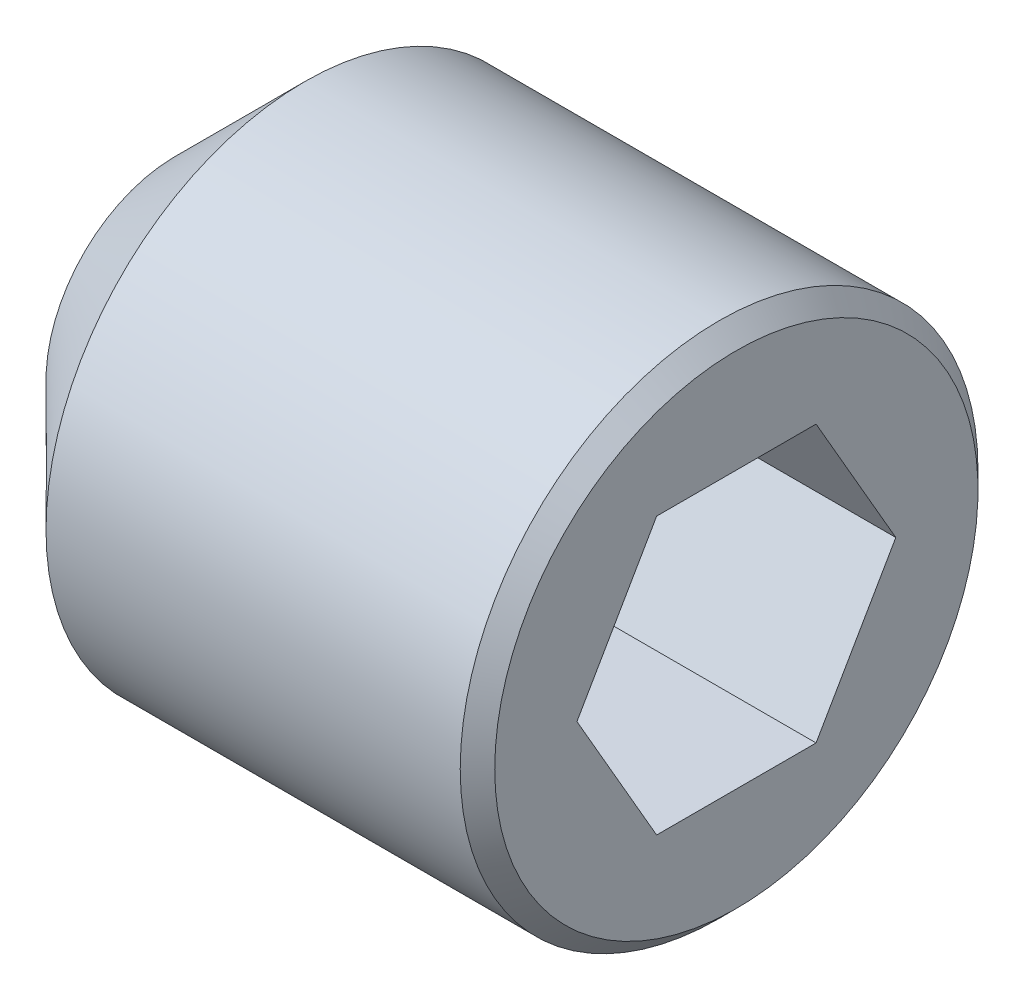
ISO-10303-21;
HEADER;
FILE_DESCRIPTION(('STEP AP214'),'2;1');
FILE_NAME('part.step','',(''),(''),'','','');
FILE_SCHEMA(('AUTOMOTIVE_DESIGN { 1 0 10303 214 1 1 1 1 }'));
ENDSEC;
DATA;
#1=APPLICATION_CONTEXT('core data for automotive mechanical design processes');
#2=APPLICATION_PROTOCOL_DEFINITION('international standard','automotive_design',2000,#1);
#3=PRODUCT_CONTEXT('',#1,'mechanical');
#4=PRODUCT('Part','Part','',(#3));
#5=PRODUCT_RELATED_PRODUCT_CATEGORY('part','',(#4));
#6=PRODUCT_DEFINITION_FORMATION('','',#4);
#7=PRODUCT_DEFINITION_CONTEXT('part definition',#1,'design');
#8=PRODUCT_DEFINITION('design','',#6,#7);
#9=PRODUCT_DEFINITION_SHAPE('','',#8);
#10=(LENGTH_UNIT() NAMED_UNIT(*) SI_UNIT(.MILLI.,.METRE.));
#11=(NAMED_UNIT(*) PLANE_ANGLE_UNIT() SI_UNIT($,.RADIAN.));
#12=(NAMED_UNIT(*) SI_UNIT($,.STERADIAN.) SOLID_ANGLE_UNIT());
#13=UNCERTAINTY_MEASURE_WITH_UNIT(LENGTH_MEASURE(1.E-05),#10,'distance_accuracy_value','');
#14=(GEOMETRIC_REPRESENTATION_CONTEXT(3) GLOBAL_UNCERTAINTY_ASSIGNED_CONTEXT((#13)) GLOBAL_UNIT_ASSIGNED_CONTEXT((#10,
#11,#12)) REPRESENTATION_CONTEXT('',''));
#15=CARTESIAN_POINT('',(0.,0.,0.));
#16=DIRECTION('',(0.,0.,1.));
#17=DIRECTION('',(1.,0.,0.));
#18=AXIS2_PLACEMENT_3D('',#15,#16,#17);
#19=CARTESIAN_POINT('',(-3.,0.,0.));
#20=DIRECTION('',(1.,0.,0.));
#21=DIRECTION('',(0.,0.,-1.));
#22=AXIS2_PLACEMENT_3D('',#19,#20,#21);
#23=PLANE('',#22);
#24=DIRECTION('',(0.,-0.866025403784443,0.499999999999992));
#25=VECTOR('',#24,1.);
#26=CARTESIAN_POINT('',(-3.,1.6,0.923760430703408));
#27=LINE('',#26,#25);
#28=CARTESIAN_POINT('',(-3.,1.6,0.923760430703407));
#29=VERTEX_POINT('',#28);
#30=CARTESIAN_POINT('',(-3.,0.,1.84752086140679));
#31=VERTEX_POINT('',#30);
#32=EDGE_CURVE('E72',#29,#31,#27,.T.);
#33=ORIENTED_EDGE('',*,*,#32,.T.);
#34=DIRECTION('',(0.,-0.866025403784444,-0.499999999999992));
#35=VECTOR('',#34,1.);
#36=CARTESIAN_POINT('',(-3.,0.,1.84752086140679));
#37=LINE('',#36,#35);
#38=CARTESIAN_POINT('',(-3.,-1.6,0.923760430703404));
#39=VERTEX_POINT('',#38);
#40=EDGE_CURVE('E121',#31,#39,#37,.T.);
#41=ORIENTED_EDGE('',*,*,#40,.T.);
#42=DIRECTION('',(0.,0.,-1.));
#43=VECTOR('',#42,1.);
#44=CARTESIAN_POINT('',(-3.,-1.6,0.923760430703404));
#45=LINE('',#44,#43);
#46=CARTESIAN_POINT('',(-3.,-1.6,-0.923760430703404));
#47=VERTEX_POINT('',#46);
#48=EDGE_CURVE('E126',#39,#47,#45,.T.);
#49=ORIENTED_EDGE('',*,*,#48,.T.);
#50=DIRECTION('',(0.,0.866025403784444,-0.499999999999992));
#51=VECTOR('',#50,1.);
#52=CARTESIAN_POINT('',(-3.,-1.6,-0.923760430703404));
#53=LINE('',#52,#51);
#54=CARTESIAN_POINT('',(-3.,0.,-1.84752086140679));
#55=VERTEX_POINT('',#54);
#56=EDGE_CURVE('E128',#47,#55,#53,.T.);
#57=ORIENTED_EDGE('',*,*,#56,.T.);
#58=DIRECTION('',(0.,0.866025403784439,0.5));
#59=VECTOR('',#58,1.);
#60=CARTESIAN_POINT('',(-3.,0.,-1.84752086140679));
#61=LINE('',#60,#59);
#62=CARTESIAN_POINT('',(-3.,1.6,-0.923760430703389));
#63=VERTEX_POINT('',#62);
#64=EDGE_CURVE('E68',#55,#63,#61,.T.);
#65=ORIENTED_EDGE('',*,*,#64,.T.);
#66=DIRECTION('',(0.,0.,1.));
#67=VECTOR('',#66,1.);
#68=CARTESIAN_POINT('',(-3.,1.6,-0.92376043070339));
#69=LINE('',#68,#67);
#70=EDGE_CURVE('E70',#63,#29,#69,.T.);
#71=ORIENTED_EDGE('',*,*,#70,.T.);
#72=EDGE_LOOP('',(#33,#41,#49,#57,#65,#71));
#73=FACE_BOUND('',#72,.T.);
#74=ADVANCED_FACE('F17',(#73),#23,.T.);
#75=CARTESIAN_POINT('',(0.,1.6,0.923760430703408));
#76=DIRECTION('',(0.,0.499999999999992,0.866025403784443));
#77=DIRECTION('',(0.,-0.866025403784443,0.499999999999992));
#78=AXIS2_PLACEMENT_3D('',#75,#76,#77);
#79=PLANE('',#78);
#80=DIRECTION('',(1.,0.,0.));
#81=VECTOR('',#80,1.);
#82=CARTESIAN_POINT('',(0.,1.6,0.923760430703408));
#83=LINE('',#82,#81);
#84=CARTESIAN_POINT('',(0.,1.6,0.923760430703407));
#85=VERTEX_POINT('',#84);
#86=EDGE_CURVE('E77',#29,#85,#83,.T.);
#87=ORIENTED_EDGE('',*,*,#86,.T.);
#88=DIRECTION('',(0.,0.866025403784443,-0.499999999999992));
#89=VECTOR('',#88,1.);
#90=CARTESIAN_POINT('',(0.,0.,1.84752086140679));
#91=LINE('',#90,#89);
#92=CARTESIAN_POINT('',(0.,0.,1.84752086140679));
#93=VERTEX_POINT('',#92);
#94=EDGE_CURVE('E118',#93,#85,#91,.T.);
#95=ORIENTED_EDGE('',*,*,#94,.F.);
#96=DIRECTION('',(1.,0.,0.));
#97=VECTOR('',#96,1.);
#98=CARTESIAN_POINT('',(0.,0.,1.84752086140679));
#99=LINE('',#98,#97);
#100=EDGE_CURVE('E83',#93,#31,#99,.F.);
#101=ORIENTED_EDGE('',*,*,#100,.T.);
#102=ORIENTED_EDGE('',*,*,#32,.F.);
#103=EDGE_LOOP('',(#87,#95,#101,#102));
#104=FACE_BOUND('',#103,.T.);
#105=ADVANCED_FACE('F80',(#104),#79,.F.);
#106=CARTESIAN_POINT('',(0.,1.6,-0.92376043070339));
#107=DIRECTION('',(0.,1.,0.));
#108=DIRECTION('',(0.,0.,1.));
#109=AXIS2_PLACEMENT_3D('',#106,#107,#108);
#110=PLANE('',#109);
#111=ORIENTED_EDGE('',*,*,#86,.F.);
#112=ORIENTED_EDGE('',*,*,#70,.F.);
#113=DIRECTION('',(1.,0.,0.));
#114=VECTOR('',#113,1.);
#115=CARTESIAN_POINT('',(0.,1.6,-0.923760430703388));
#116=LINE('',#115,#114);
#117=CARTESIAN_POINT('',(0.,1.6,-0.923760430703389));
#118=VERTEX_POINT('',#117);
#119=EDGE_CURVE('E91',#63,#118,#116,.T.);
#120=ORIENTED_EDGE('',*,*,#119,.T.);
#121=DIRECTION('',(0.,0.,-1.));
#122=VECTOR('',#121,1.);
#123=CARTESIAN_POINT('',(0.,1.6,0.));
#124=LINE('',#123,#122);
#125=EDGE_CURVE('E88',#85,#118,#124,.T.);
#126=ORIENTED_EDGE('',*,*,#125,.F.);
#127=EDGE_LOOP('',(#111,#112,#120,#126));
#128=FACE_BOUND('',#127,.T.);
#129=ADVANCED_FACE('F86',(#128),#110,.F.);
#130=CARTESIAN_POINT('',(0.,0.,-1.84752086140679));
#131=DIRECTION('',(0.,0.5,-0.866025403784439));
#132=DIRECTION('',(0.,0.866025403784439,0.5));
#133=AXIS2_PLACEMENT_3D('',#130,#131,#132);
#134=PLANE('',#133);
#135=ORIENTED_EDGE('',*,*,#119,.F.);
#136=ORIENTED_EDGE('',*,*,#64,.F.);
#137=DIRECTION('',(1.,0.,0.));
#138=VECTOR('',#137,1.);
#139=CARTESIAN_POINT('',(0.,0.,-1.84752086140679));
#140=LINE('',#139,#138);
#141=CARTESIAN_POINT('',(0.,0.,-1.84752086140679));
#142=VERTEX_POINT('',#141);
#143=EDGE_CURVE('E130',#55,#142,#140,.T.);
#144=ORIENTED_EDGE('',*,*,#143,.T.);
#145=DIRECTION('',(0.,-0.866025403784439,-0.499999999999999));
#146=VECTOR('',#145,1.);
#147=CARTESIAN_POINT('',(0.,1.6,-0.92376043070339));
#148=LINE('',#147,#146);
#149=EDGE_CURVE('E114',#118,#142,#148,.T.);
#150=ORIENTED_EDGE('',*,*,#149,.F.);
#151=EDGE_LOOP('',(#135,#136,#144,#150));
#152=FACE_BOUND('',#151,.T.);
#153=ADVANCED_FACE('F133',(#152),#134,.F.);
#154=CARTESIAN_POINT('',(0.,-1.6,-0.923760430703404));
#155=DIRECTION('',(0.,-0.499999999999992,-0.866025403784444));
#156=DIRECTION('',(0.,0.866025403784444,-0.499999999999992));
#157=AXIS2_PLACEMENT_3D('',#154,#155,#156);
#158=PLANE('',#157);
#159=DIRECTION('',(1.,0.,0.));
#160=VECTOR('',#159,1.);
#161=CARTESIAN_POINT('',(0.,-1.6,-0.923760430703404));
#162=LINE('',#161,#160);
#163=CARTESIAN_POINT('',(0.,-1.6,-0.923760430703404));
#164=VERTEX_POINT('',#163);
#165=EDGE_CURVE('E124',#47,#164,#162,.T.);
#166=ORIENTED_EDGE('',*,*,#165,.T.);
#167=DIRECTION('',(0.,-0.866025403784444,0.499999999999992));
#168=VECTOR('',#167,1.);
#169=CARTESIAN_POINT('',(0.,0.,-1.84752086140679));
#170=LINE('',#169,#168);
#171=EDGE_CURVE('E109',#142,#164,#170,.T.);
#172=ORIENTED_EDGE('',*,*,#171,.F.);
#173=ORIENTED_EDGE('',*,*,#143,.F.);
#174=ORIENTED_EDGE('',*,*,#56,.F.);
#175=EDGE_LOOP('',(#166,#172,#173,#174));
#176=FACE_BOUND('',#175,.T.);
#177=ADVANCED_FACE('F144',(#176),#158,.F.);
#178=CARTESIAN_POINT('',(0.,-1.6,0.923760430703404));
#179=DIRECTION('',(0.,-1.,0.));
#180=DIRECTION('',(0.,0.,-1.));
#181=AXIS2_PLACEMENT_3D('',#178,#179,#180);
#182=PLANE('',#181);
#183=DIRECTION('',(0.,0.,-1.));
#184=VECTOR('',#183,1.);
#185=CARTESIAN_POINT('',(0.,-1.6,0.));
#186=LINE('',#185,#184);
#187=CARTESIAN_POINT('',(0.,-1.6,0.923760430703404));
#188=VERTEX_POINT('',#187);
#189=EDGE_CURVE('E105',#164,#188,#186,.F.);
#190=ORIENTED_EDGE('',*,*,#189,.F.);
#191=ORIENTED_EDGE('',*,*,#165,.F.);
#192=ORIENTED_EDGE('',*,*,#48,.F.);
#193=DIRECTION('',(1.,0.,0.));
#194=VECTOR('',#193,1.);
#195=CARTESIAN_POINT('',(0.,-1.6,0.923760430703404));
#196=LINE('',#195,#194);
#197=EDGE_CURVE('E35',#39,#188,#196,.T.);
#198=ORIENTED_EDGE('',*,*,#197,.T.);
#199=EDGE_LOOP('',(#190,#191,#192,#198));
#200=FACE_BOUND('',#199,.T.);
#201=ADVANCED_FACE('F142',(#200),#182,.F.);
#202=CARTESIAN_POINT('',(0.,0.,1.84752086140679));
#203=DIRECTION('',(0.,-0.499999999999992,0.866025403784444));
#204=DIRECTION('',(0.,-0.866025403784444,-0.499999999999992));
#205=AXIS2_PLACEMENT_3D('',#202,#203,#204);
#206=PLANE('',#205);
#207=ORIENTED_EDGE('',*,*,#197,.F.);
#208=ORIENTED_EDGE('',*,*,#40,.F.);
#209=ORIENTED_EDGE('',*,*,#100,.F.);
#210=DIRECTION('',(0.,0.866025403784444,0.499999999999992));
#211=VECTOR('',#210,1.);
#212=CARTESIAN_POINT('',(0.,-1.6,0.923760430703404));
#213=LINE('',#212,#211);
#214=EDGE_CURVE('E101',#188,#93,#213,.T.);
#215=ORIENTED_EDGE('',*,*,#214,.F.);
#216=EDGE_LOOP('',(#207,#208,#209,#215));
#217=FACE_BOUND('',#216,.T.);
#218=ADVANCED_FACE('F139',(#217),#206,.F.);
#219=CARTESIAN_POINT('',(-6.5,0.,0.));
#220=DIRECTION('',(1.,0.,0.));
#221=DIRECTION('',(0.,0.,-1.));
#222=AXIS2_PLACEMENT_3D('',#219,#220,#221);
#223=PLANE('',#222);
#224=CARTESIAN_POINT('',(-6.49999999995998,0.,0.));
#225=DIRECTION('',(1.,0.,0.));
#226=DIRECTION('',(0.,0.,-1.));
#227=AXIS2_PLACEMENT_3D('',#224,#225,#226);
#228=CIRCLE('',#227,1.49999999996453);
#229=CARTESIAN_POINT('',(-6.49999999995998,0.,-1.49999999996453));
#230=VERTEX_POINT('',#229);
#231=EDGE_CURVE('E20',#230,#230,#228,.T.);
#232=ORIENTED_EDGE('',*,*,#231,.F.);
#233=EDGE_LOOP('',(#232));
#234=FACE_BOUND('',#233,.T.);
#235=ADVANCED_FACE('F171',(#234),#223,.F.);
#236=CARTESIAN_POINT('',(0.,0.,0.));
#237=DIRECTION('',(1.,0.,0.));
#238=DIRECTION('',(0.,0.,-1.));
#239=AXIS2_PLACEMENT_3D('',#236,#237,#238);
#240=PLANE('',#239);
#241=ORIENTED_EDGE('',*,*,#189,.T.);
#242=ORIENTED_EDGE('',*,*,#214,.T.);
#243=ORIENTED_EDGE('',*,*,#94,.T.);
#244=ORIENTED_EDGE('',*,*,#125,.T.);
#245=ORIENTED_EDGE('',*,*,#149,.T.);
#246=ORIENTED_EDGE('',*,*,#171,.T.);
#247=EDGE_LOOP('',(#241,#242,#243,#244,#245,#246));
#248=FACE_BOUND('',#247,.T.);
#249=CARTESIAN_POINT('',(0.,0.,0.));
#250=DIRECTION('',(-1.,0.,0.));
#251=DIRECTION('',(0.,0.,1.));
#252=AXIS2_PLACEMENT_3D('',#249,#250,#251);
#253=CIRCLE('',#252,2.79999999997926);
#254=CARTESIAN_POINT('',(0.,0.,2.79999999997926));
#255=VERTEX_POINT('',#254);
#256=EDGE_CURVE('E94',#255,#255,#253,.T.);
#257=ORIENTED_EDGE('',*,*,#256,.F.);
#258=EDGE_LOOP('',(#257));
#259=FACE_BOUND('',#258,.T.);
#260=ADVANCED_FACE('F136',(#248,#259),#240,.T.);
#261=CARTESIAN_POINT('',(-4.99999999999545,0.,0.));
#262=DIRECTION('',(1.,0.,0.));
#263=DIRECTION('',(0.,0.,-1.));
#264=AXIS2_PLACEMENT_3D('',#261,#262,#263);
#265=CONICAL_SURFACE('',#264,2.9999999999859,0.785398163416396);
#266=CARTESIAN_POINT('',(-5.,0.,0.));
#267=DIRECTION('',(1.,0.,0.));
#268=DIRECTION('',(0.,0.,-1.));
#269=AXIS2_PLACEMENT_3D('',#266,#267,#268);
#270=CIRCLE('',#269,3.);
#271=CARTESIAN_POINT('',(-5.,0.,-3.));
#272=VERTEX_POINT('',#271);
#273=EDGE_CURVE('E26',#272,#272,#270,.T.);
#274=ORIENTED_EDGE('',*,*,#273,.F.);
#275=EDGE_LOOP('',(#274));
#276=FACE_BOUND('',#275,.T.);
#277=ORIENTED_EDGE('',*,*,#231,.T.);
#278=EDGE_LOOP('',(#277));
#279=FACE_BOUND('',#278,.T.);
#280=ADVANCED_FACE('F162',(#276,#279),#265,.T.);
#281=CARTESIAN_POINT('',(-0.200000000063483,0.,0.));
#282=DIRECTION('',(-1.,0.,0.));
#283=DIRECTION('',(0.,0.,1.));
#284=AXIS2_PLACEMENT_3D('',#281,#282,#283);
#285=CONICAL_SURFACE('',#284,3.00000000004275,0.785398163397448);
#286=ORIENTED_EDGE('',*,*,#256,.T.);
#287=EDGE_LOOP('',(#286));
#288=FACE_BOUND('',#287,.T.);
#289=CARTESIAN_POINT('',(-0.200000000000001,0.,0.));
#290=DIRECTION('',(1.,0.,0.));
#291=DIRECTION('',(0.,0.,-1.));
#292=AXIS2_PLACEMENT_3D('',#289,#290,#291);
#293=CIRCLE('',#292,3.);
#294=CARTESIAN_POINT('',(-0.200000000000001,0.,-3.));
#295=VERTEX_POINT('',#294);
#296=EDGE_CURVE('E11',#295,#295,#293,.F.);
#297=ORIENTED_EDGE('',*,*,#296,.F.);
#298=EDGE_LOOP('',(#297));
#299=FACE_BOUND('',#298,.T.);
#300=ADVANCED_FACE('F156',(#288,#299),#285,.T.);
#301=CARTESIAN_POINT('',(-6.825,0.,0.));
#302=DIRECTION('',(1.,0.,0.));
#303=DIRECTION('',(0.,0.,-1.));
#304=AXIS2_PLACEMENT_3D('',#301,#302,#303);
#305=CYLINDRICAL_SURFACE('',#304,3.);
#306=ORIENTED_EDGE('',*,*,#296,.T.);
#307=EDGE_LOOP('',(#306));
#308=FACE_BOUND('',#307,.T.);
#309=ORIENTED_EDGE('',*,*,#273,.T.);
#310=EDGE_LOOP('',(#309));
#311=FACE_BOUND('',#310,.T.);
#312=ADVANCED_FACE('F154',(#308,#311),#305,.T.);
#313=CLOSED_SHELL('',(#74,#105,#129,#153,#177,#201,#218,#235,#260,#280,#300,#312));
#314=MANIFOLD_SOLID_BREP('B1',#313);
#315=ADVANCED_BREP_SHAPE_REPRESENTATION('',(#18,#314),#14);
#316=SHAPE_DEFINITION_REPRESENTATION(#9,#315);
ENDSEC;
END-ISO-10303-21;
